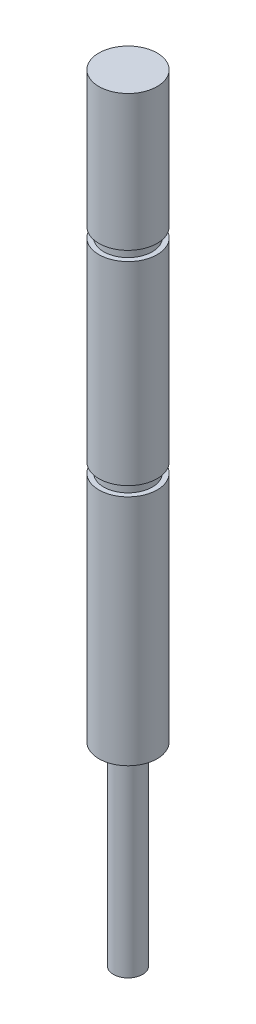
ISO-10303-21;
HEADER;
FILE_DESCRIPTION(('STEP AP214'),'2;1');
FILE_NAME('part.step','',(''),(''),'','','');
FILE_SCHEMA(('AUTOMOTIVE_DESIGN { 1 0 10303 214 1 1 1 1 }'));
ENDSEC;
DATA;
#1=APPLICATION_CONTEXT('core data for automotive mechanical design processes');
#2=APPLICATION_PROTOCOL_DEFINITION('international standard','automotive_design',2000,#1);
#3=PRODUCT_CONTEXT('',#1,'mechanical');
#4=PRODUCT('Part','Part','',(#3));
#5=PRODUCT_RELATED_PRODUCT_CATEGORY('part','',(#4));
#6=PRODUCT_DEFINITION_FORMATION('','',#4);
#7=PRODUCT_DEFINITION_CONTEXT('part definition',#1,'design');
#8=PRODUCT_DEFINITION('design','',#6,#7);
#9=PRODUCT_DEFINITION_SHAPE('','',#8);
#10=(LENGTH_UNIT() NAMED_UNIT(*) SI_UNIT(.MILLI.,.METRE.));
#11=(NAMED_UNIT(*) PLANE_ANGLE_UNIT() SI_UNIT($,.RADIAN.));
#12=(NAMED_UNIT(*) SI_UNIT($,.STERADIAN.) SOLID_ANGLE_UNIT());
#13=UNCERTAINTY_MEASURE_WITH_UNIT(LENGTH_MEASURE(1.E-05),#10,'distance_accuracy_value','');
#14=(GEOMETRIC_REPRESENTATION_CONTEXT(3) GLOBAL_UNCERTAINTY_ASSIGNED_CONTEXT((#13)) GLOBAL_UNIT_ASSIGNED_CONTEXT((#10,
#11,#12)) REPRESENTATION_CONTEXT('',''));
#15=CARTESIAN_POINT('',(0.,0.,0.));
#16=DIRECTION('',(0.,0.,1.));
#17=DIRECTION('',(1.,0.,0.));
#18=AXIS2_PLACEMENT_3D('',#15,#16,#17);
#19=CARTESIAN_POINT('',(0.,80.,0.));
#20=DIRECTION('',(0.,1.,0.));
#21=DIRECTION('',(0.,0.,1.));
#22=AXIS2_PLACEMENT_3D('',#19,#20,#21);
#23=PLANE('',#22);
#24=CARTESIAN_POINT('',(0.,80.,0.));
#25=DIRECTION('',(0.,-1.,0.));
#26=DIRECTION('',(0.,0.,-1.));
#27=AXIS2_PLACEMENT_3D('',#24,#25,#26);
#28=CIRCLE('',#27,3.);
#29=CARTESIAN_POINT('',(0.,80.,-3.));
#30=VERTEX_POINT('',#29);
#31=EDGE_CURVE('E18',#30,#30,#28,.T.);
#32=ORIENTED_EDGE('',*,*,#31,.F.);
#33=EDGE_LOOP('',(#32));
#34=FACE_BOUND('',#33,.T.);
#35=ADVANCED_FACE('F15',(#34),#23,.T.);
#36=CARTESIAN_POINT('',(0.,80.,0.));
#37=DIRECTION('',(0.,-1.,0.));
#38=DIRECTION('',(0.,0.,-1.));
#39=AXIS2_PLACEMENT_3D('',#36,#37,#38);
#40=CYLINDRICAL_SURFACE('',#39,3.);
#41=CARTESIAN_POINT('',(0.,66.,0.));
#42=DIRECTION('',(0.,-1.,0.));
#43=DIRECTION('',(0.,0.,-1.));
#44=AXIS2_PLACEMENT_3D('',#41,#42,#43);
#45=CIRCLE('',#44,3.);
#46=CARTESIAN_POINT('',(0.,66.,-3.));
#47=VERTEX_POINT('',#46);
#48=EDGE_CURVE('E52',#47,#47,#45,.T.);
#49=ORIENTED_EDGE('',*,*,#48,.F.);
#50=EDGE_LOOP('',(#49));
#51=FACE_BOUND('',#50,.T.);
#52=ORIENTED_EDGE('',*,*,#31,.T.);
#53=EDGE_LOOP('',(#52));
#54=FACE_BOUND('',#53,.T.);
#55=ADVANCED_FACE('F59',(#51,#54),#40,.T.);
#56=CARTESIAN_POINT('',(3.,66.,0.));
#57=DIRECTION('',(0.,-1.,0.));
#58=DIRECTION('',(0.,0.,-1.));
#59=AXIS2_PLACEMENT_3D('',#56,#57,#58);
#60=PLANE('',#59);
#61=ORIENTED_EDGE('',*,*,#48,.T.);
#62=EDGE_LOOP('',(#61));
#63=FACE_BOUND('',#62,.T.);
#64=CARTESIAN_POINT('',(0.,66.,0.));
#65=DIRECTION('',(0.,1.,0.));
#66=DIRECTION('',(0.,0.,1.));
#67=AXIS2_PLACEMENT_3D('',#64,#65,#66);
#68=CIRCLE('',#67,2.5);
#69=CARTESIAN_POINT('',(0.,66.,2.5));
#70=VERTEX_POINT('',#69);
#71=EDGE_CURVE('E50',#70,#70,#68,.F.);
#72=ORIENTED_EDGE('',*,*,#71,.F.);
#73=EDGE_LOOP('',(#72));
#74=FACE_BOUND('',#73,.T.);
#75=ADVANCED_FACE('F66',(#63,#74),#60,.T.);
#76=CARTESIAN_POINT('',(0.,80.,0.));
#77=DIRECTION('',(0.,1.,0.));
#78=DIRECTION('',(0.,0.,1.));
#79=AXIS2_PLACEMENT_3D('',#76,#77,#78);
#80=CYLINDRICAL_SURFACE('',#79,2.5);
#81=CARTESIAN_POINT('',(0.,65.,0.));
#82=DIRECTION('',(0.,1.,0.));
#83=DIRECTION('',(0.,0.,1.));
#84=AXIS2_PLACEMENT_3D('',#81,#82,#83);
#85=CIRCLE('',#84,2.5);
#86=CARTESIAN_POINT('',(0.,65.,2.5));
#87=VERTEX_POINT('',#86);
#88=EDGE_CURVE('E47',#87,#87,#85,.F.);
#89=ORIENTED_EDGE('',*,*,#88,.F.);
#90=EDGE_LOOP('',(#89));
#91=FACE_BOUND('',#90,.T.);
#92=ORIENTED_EDGE('',*,*,#71,.T.);
#93=EDGE_LOOP('',(#92));
#94=FACE_BOUND('',#93,.T.);
#95=ADVANCED_FACE('F106',(#91,#94),#80,.T.);
#96=CARTESIAN_POINT('',(3.,65.,0.));
#97=DIRECTION('',(0.,1.,0.));
#98=DIRECTION('',(0.,0.,1.));
#99=AXIS2_PLACEMENT_3D('',#96,#97,#98);
#100=PLANE('',#99);
#101=ORIENTED_EDGE('',*,*,#88,.T.);
#102=EDGE_LOOP('',(#101));
#103=FACE_BOUND('',#102,.T.);
#104=CARTESIAN_POINT('',(0.,65.,0.));
#105=DIRECTION('',(0.,-1.,0.));
#106=DIRECTION('',(0.,0.,-1.));
#107=AXIS2_PLACEMENT_3D('',#104,#105,#106);
#108=CIRCLE('',#107,3.);
#109=CARTESIAN_POINT('',(0.,65.,-3.));
#110=VERTEX_POINT('',#109);
#111=EDGE_CURVE('E44',#110,#110,#108,.T.);
#112=ORIENTED_EDGE('',*,*,#111,.F.);
#113=EDGE_LOOP('',(#112));
#114=FACE_BOUND('',#113,.T.);
#115=ADVANCED_FACE('F102',(#103,#114),#100,.T.);
#116=CARTESIAN_POINT('',(0.,80.,0.));
#117=DIRECTION('',(0.,-1.,0.));
#118=DIRECTION('',(0.,0.,-1.));
#119=AXIS2_PLACEMENT_3D('',#116,#117,#118);
#120=CYLINDRICAL_SURFACE('',#119,3.);
#121=CARTESIAN_POINT('',(0.,45.,0.));
#122=DIRECTION('',(0.,-1.,0.));
#123=DIRECTION('',(0.,0.,-1.));
#124=AXIS2_PLACEMENT_3D('',#121,#122,#123);
#125=CIRCLE('',#124,3.);
#126=CARTESIAN_POINT('',(0.,45.,-3.));
#127=VERTEX_POINT('',#126);
#128=EDGE_CURVE('E41',#127,#127,#125,.T.);
#129=ORIENTED_EDGE('',*,*,#128,.F.);
#130=EDGE_LOOP('',(#129));
#131=FACE_BOUND('',#130,.T.);
#132=ORIENTED_EDGE('',*,*,#111,.T.);
#133=EDGE_LOOP('',(#132));
#134=FACE_BOUND('',#133,.T.);
#135=ADVANCED_FACE('F98',(#131,#134),#120,.T.);
#136=CARTESIAN_POINT('',(3.,45.,0.));
#137=DIRECTION('',(0.,-1.,0.));
#138=DIRECTION('',(0.,0.,-1.));
#139=AXIS2_PLACEMENT_3D('',#136,#137,#138);
#140=PLANE('',#139);
#141=ORIENTED_EDGE('',*,*,#128,.T.);
#142=EDGE_LOOP('',(#141));
#143=FACE_BOUND('',#142,.T.);
#144=CARTESIAN_POINT('',(0.,45.,0.));
#145=DIRECTION('',(0.,1.,0.));
#146=DIRECTION('',(0.,0.,1.));
#147=AXIS2_PLACEMENT_3D('',#144,#145,#146);
#148=CIRCLE('',#147,2.5);
#149=CARTESIAN_POINT('',(0.,45.,2.5));
#150=VERTEX_POINT('',#149);
#151=EDGE_CURVE('E38',#150,#150,#148,.F.);
#152=ORIENTED_EDGE('',*,*,#151,.F.);
#153=EDGE_LOOP('',(#152));
#154=FACE_BOUND('',#153,.T.);
#155=ADVANCED_FACE('F94',(#143,#154),#140,.T.);
#156=CARTESIAN_POINT('',(0.,0.,0.));
#157=DIRECTION('',(0.,1.,0.));
#158=DIRECTION('',(0.,0.,1.));
#159=AXIS2_PLACEMENT_3D('',#156,#157,#158);
#160=PLANE('',#159);
#161=CARTESIAN_POINT('',(0.,0.,0.));
#162=DIRECTION('',(0.,-1.,0.));
#163=DIRECTION('',(0.,0.,-1.));
#164=AXIS2_PLACEMENT_3D('',#161,#162,#163);
#165=CIRCLE('',#164,1.5);
#166=CARTESIAN_POINT('',(0.,0.,-1.5));
#167=VERTEX_POINT('',#166);
#168=EDGE_CURVE('E35',#167,#167,#165,.F.);
#169=ORIENTED_EDGE('',*,*,#168,.F.);
#170=EDGE_LOOP('',(#169));
#171=FACE_BOUND('',#170,.T.);
#172=ADVANCED_FACE('F90',(#171),#160,.F.);
#173=CARTESIAN_POINT('',(0.,80.,0.));
#174=DIRECTION('',(0.,1.,0.));
#175=DIRECTION('',(0.,0.,1.));
#176=AXIS2_PLACEMENT_3D('',#173,#174,#175);
#177=CYLINDRICAL_SURFACE('',#176,2.5);
#178=CARTESIAN_POINT('',(0.,44.,0.));
#179=DIRECTION('',(0.,1.,0.));
#180=DIRECTION('',(0.,0.,1.));
#181=AXIS2_PLACEMENT_3D('',#178,#179,#180);
#182=CIRCLE('',#181,2.5);
#183=CARTESIAN_POINT('',(0.,44.,2.5));
#184=VERTEX_POINT('',#183);
#185=EDGE_CURVE('E32',#184,#184,#182,.F.);
#186=ORIENTED_EDGE('',*,*,#185,.F.);
#187=EDGE_LOOP('',(#186));
#188=FACE_BOUND('',#187,.T.);
#189=ORIENTED_EDGE('',*,*,#151,.T.);
#190=EDGE_LOOP('',(#189));
#191=FACE_BOUND('',#190,.T.);
#192=ADVANCED_FACE('F86',(#188,#191),#177,.T.);
#193=CARTESIAN_POINT('',(0.,20.,0.));
#194=DIRECTION('',(0.,-1.,0.));
#195=DIRECTION('',(0.,0.,-1.));
#196=AXIS2_PLACEMENT_3D('',#193,#194,#195);
#197=CYLINDRICAL_SURFACE('',#196,1.5);
#198=CARTESIAN_POINT('',(0.,20.,0.));
#199=DIRECTION('',(0.,-1.,0.));
#200=DIRECTION('',(0.,0.,-1.));
#201=AXIS2_PLACEMENT_3D('',#198,#199,#200);
#202=CIRCLE('',#201,1.5);
#203=CARTESIAN_POINT('',(0.,20.,-1.5));
#204=VERTEX_POINT('',#203);
#205=EDGE_CURVE('E27',#204,#204,#202,.F.);
#206=ORIENTED_EDGE('',*,*,#205,.F.);
#207=EDGE_LOOP('',(#206));
#208=FACE_BOUND('',#207,.T.);
#209=ORIENTED_EDGE('',*,*,#168,.T.);
#210=EDGE_LOOP('',(#209));
#211=FACE_BOUND('',#210,.T.);
#212=ADVANCED_FACE('F82',(#208,#211),#197,.T.);
#213=CARTESIAN_POINT('',(3.,44.,0.));
#214=DIRECTION('',(0.,1.,0.));
#215=DIRECTION('',(0.,0.,1.));
#216=AXIS2_PLACEMENT_3D('',#213,#214,#215);
#217=PLANE('',#216);
#218=ORIENTED_EDGE('',*,*,#185,.T.);
#219=EDGE_LOOP('',(#218));
#220=FACE_BOUND('',#219,.T.);
#221=CARTESIAN_POINT('',(0.,44.,0.));
#222=DIRECTION('',(0.,-1.,0.));
#223=DIRECTION('',(0.,0.,-1.));
#224=AXIS2_PLACEMENT_3D('',#221,#222,#223);
#225=CIRCLE('',#224,3.);
#226=CARTESIAN_POINT('',(0.,44.,-3.));
#227=VERTEX_POINT('',#226);
#228=EDGE_CURVE('E22',#227,#227,#225,.T.);
#229=ORIENTED_EDGE('',*,*,#228,.F.);
#230=EDGE_LOOP('',(#229));
#231=FACE_BOUND('',#230,.T.);
#232=ADVANCED_FACE('F75',(#220,#231),#217,.T.);
#233=CARTESIAN_POINT('',(0.,20.,0.));
#234=DIRECTION('',(0.,-1.,0.));
#235=DIRECTION('',(0.,0.,-1.));
#236=AXIS2_PLACEMENT_3D('',#233,#234,#235);
#237=PLANE('',#236);
#238=CARTESIAN_POINT('',(0.,20.,0.));
#239=DIRECTION('',(0.,-1.,0.));
#240=DIRECTION('',(0.,0.,-1.));
#241=AXIS2_PLACEMENT_3D('',#238,#239,#240);
#242=CIRCLE('',#241,3.);
#243=CARTESIAN_POINT('',(0.,20.,-3.));
#244=VERTEX_POINT('',#243);
#245=EDGE_CURVE('E10',#244,#244,#242,.F.);
#246=ORIENTED_EDGE('',*,*,#245,.F.);
#247=EDGE_LOOP('',(#246));
#248=FACE_BOUND('',#247,.T.);
#249=ORIENTED_EDGE('',*,*,#205,.T.);
#250=EDGE_LOOP('',(#249));
#251=FACE_BOUND('',#250,.T.);
#252=ADVANCED_FACE('F70',(#248,#251),#237,.T.);
#253=CARTESIAN_POINT('',(0.,80.,0.));
#254=DIRECTION('',(0.,-1.,0.));
#255=DIRECTION('',(0.,0.,-1.));
#256=AXIS2_PLACEMENT_3D('',#253,#254,#255);
#257=CYLINDRICAL_SURFACE('',#256,3.);
#258=ORIENTED_EDGE('',*,*,#245,.T.);
#259=EDGE_LOOP('',(#258));
#260=FACE_BOUND('',#259,.T.);
#261=ORIENTED_EDGE('',*,*,#228,.T.);
#262=EDGE_LOOP('',(#261));
#263=FACE_BOUND('',#262,.T.);
#264=ADVANCED_FACE('F68',(#260,#263),#257,.T.);
#265=CLOSED_SHELL('',(#35,#55,#75,#95,#115,#135,#155,#172,#192,#212,#232,#252,#264));
#266=MANIFOLD_SOLID_BREP('B1',#265);
#267=ADVANCED_BREP_SHAPE_REPRESENTATION('',(#18,#266),#14);
#268=SHAPE_DEFINITION_REPRESENTATION(#9,#267);
ENDSEC;
END-ISO-10303-21;
